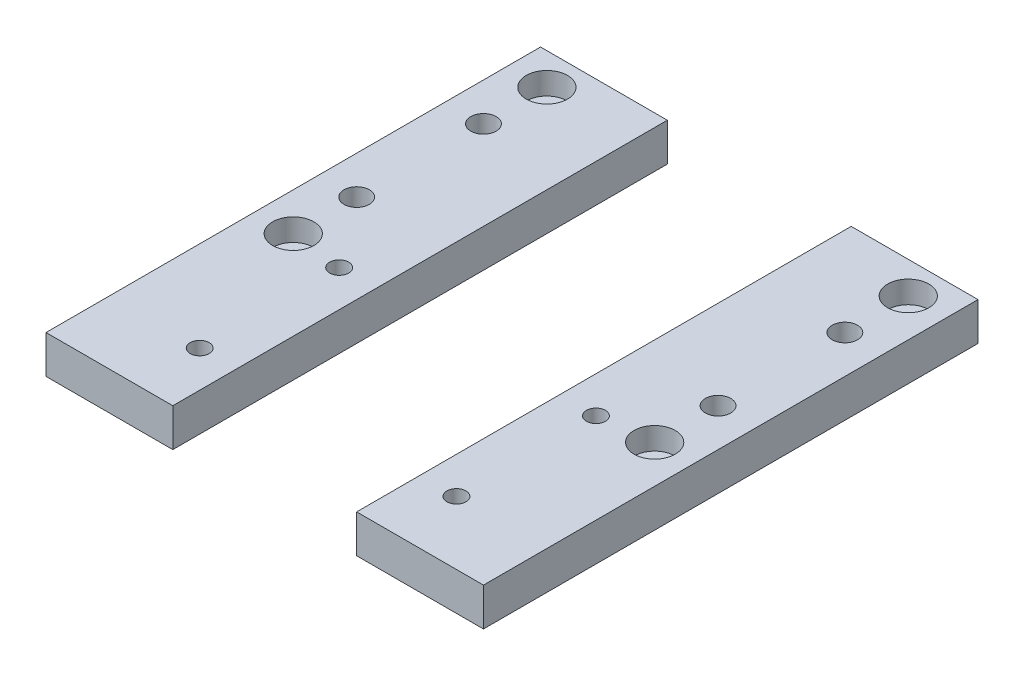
ISO-10303-21;
HEADER;
FILE_DESCRIPTION(('STEP AP214'),'2;1');
FILE_NAME('part.step','',(''),(''),'','','');
FILE_SCHEMA(('AUTOMOTIVE_DESIGN { 1 0 10303 214 1 1 1 1 }'));
ENDSEC;
DATA;
#1=APPLICATION_CONTEXT('core data for automotive mechanical design processes');
#2=APPLICATION_PROTOCOL_DEFINITION('international standard','automotive_design',2000,#1);
#3=PRODUCT_CONTEXT('',#1,'mechanical');
#4=PRODUCT('Part','Part','',(#3));
#5=PRODUCT_RELATED_PRODUCT_CATEGORY('part','',(#4));
#6=PRODUCT_DEFINITION_FORMATION('','',#4);
#7=PRODUCT_DEFINITION_CONTEXT('part definition',#1,'design');
#8=PRODUCT_DEFINITION('design','',#6,#7);
#9=PRODUCT_DEFINITION_SHAPE('','',#8);
#10=(LENGTH_UNIT() NAMED_UNIT(*) SI_UNIT(.MILLI.,.METRE.));
#11=(NAMED_UNIT(*) PLANE_ANGLE_UNIT() SI_UNIT($,.RADIAN.));
#12=(NAMED_UNIT(*) SI_UNIT($,.STERADIAN.) SOLID_ANGLE_UNIT());
#13=UNCERTAINTY_MEASURE_WITH_UNIT(LENGTH_MEASURE(1.E-05),#10,'distance_accuracy_value','');
#14=(GEOMETRIC_REPRESENTATION_CONTEXT(3) GLOBAL_UNCERTAINTY_ASSIGNED_CONTEXT((#13)) GLOBAL_UNIT_ASSIGNED_CONTEXT((#10,
#11,#12)) REPRESENTATION_CONTEXT('',''));
#15=CARTESIAN_POINT('',(0.,0.,0.));
#16=DIRECTION('',(0.,0.,1.));
#17=DIRECTION('',(1.,0.,0.));
#18=AXIS2_PLACEMENT_3D('',#15,#16,#17);
#19=CARTESIAN_POINT('',(62.9999999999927,-72.0000000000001,5.));
#20=DIRECTION('',(0.,1.,0.));
#21=DIRECTION('',(0.,0.,1.));
#22=AXIS2_PLACEMENT_3D('',#19,#20,#21);
#23=CYLINDRICAL_SURFACE('',#22,1.75);
#24=CARTESIAN_POINT('',(62.9999999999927,-1.11022302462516E-13,5.));
#25=DIRECTION('',(0.,1.,0.));
#26=DIRECTION('',(0.,0.,1.));
#27=AXIS2_PLACEMENT_3D('',#24,#25,#26);
#28=CIRCLE('',#27,1.75);
#29=CARTESIAN_POINT('',(62.9999999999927,-1.11022302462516E-13,6.75));
#30=VERTEX_POINT('',#29);
#31=EDGE_CURVE('E118',#30,#30,#28,.T.);
#32=ORIENTED_EDGE('',*,*,#31,.F.);
#33=EDGE_LOOP('',(#32));
#34=FACE_BOUND('',#33,.T.);
#35=CARTESIAN_POINT('',(62.9999999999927,2.49999999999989,5.));
#36=DIRECTION('',(0.,1.,0.));
#37=DIRECTION('',(0.,0.,1.));
#38=AXIS2_PLACEMENT_3D('',#35,#36,#37);
#39=CIRCLE('',#38,1.75);
#40=CARTESIAN_POINT('',(62.9999999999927,2.49999999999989,6.75));
#41=VERTEX_POINT('',#40);
#42=EDGE_CURVE('E46',#41,#41,#39,.F.);
#43=ORIENTED_EDGE('',*,*,#42,.F.);
#44=EDGE_LOOP('',(#43));
#45=FACE_BOUND('',#44,.T.);
#46=ADVANCED_FACE('F42',(#34,#45),#23,.F.);
#47=CARTESIAN_POINT('',(62.9999999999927,-72.0000000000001,45.));
#48=DIRECTION('',(0.,1.,0.));
#49=DIRECTION('',(0.,0.,1.));
#50=AXIS2_PLACEMENT_3D('',#47,#48,#49);
#51=CYLINDRICAL_SURFACE('',#50,1.75);
#52=CARTESIAN_POINT('',(62.9999999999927,-1.11022302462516E-13,45.));
#53=DIRECTION('',(0.,1.,0.));
#54=DIRECTION('',(0.,0.,1.));
#55=AXIS2_PLACEMENT_3D('',#52,#53,#54);
#56=CIRCLE('',#55,1.75);
#57=CARTESIAN_POINT('',(62.9999999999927,-1.11022302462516E-13,46.75));
#58=VERTEX_POINT('',#57);
#59=EDGE_CURVE('E121',#58,#58,#56,.T.);
#60=ORIENTED_EDGE('',*,*,#59,.F.);
#61=EDGE_LOOP('',(#60));
#62=FACE_BOUND('',#61,.T.);
#63=CARTESIAN_POINT('',(62.9999999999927,2.49999999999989,45.));
#64=DIRECTION('',(0.,1.,0.));
#65=DIRECTION('',(0.,0.,1.));
#66=AXIS2_PLACEMENT_3D('',#63,#64,#65);
#67=CIRCLE('',#66,1.75);
#68=CARTESIAN_POINT('',(62.9999999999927,2.49999999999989,46.75));
#69=VERTEX_POINT('',#68);
#70=EDGE_CURVE('E135',#69,#69,#67,.F.);
#71=ORIENTED_EDGE('',*,*,#70,.F.);
#72=EDGE_LOOP('',(#71));
#73=FACE_BOUND('',#72,.T.);
#74=ADVANCED_FACE('F178',(#62,#73),#51,.F.);
#75=CARTESIAN_POINT('',(68.9999999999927,-1.13686837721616E-13,78.));
#76=DIRECTION('',(-1.,0.,0.));
#77=DIRECTION('',(0.,0.,1.));
#78=AXIS2_PLACEMENT_3D('',#75,#76,#77);
#79=PLANE('',#78);
#80=DIRECTION('',(0.,1.,0.));
#81=VECTOR('',#80,1.);
#82=CARTESIAN_POINT('',(68.9999999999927,-1.13686837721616E-13,0.));
#83=LINE('',#82,#81);
#84=CARTESIAN_POINT('',(68.9999999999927,-1.13686837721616E-13,0.));
#85=VERTEX_POINT('',#84);
#86=CARTESIAN_POINT('',(68.9999999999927,5.99999999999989,0.));
#87=VERTEX_POINT('',#86);
#88=EDGE_CURVE('E109',#85,#87,#83,.T.);
#89=ORIENTED_EDGE('',*,*,#88,.T.);
#90=DIRECTION('',(0.,0.,-1.));
#91=VECTOR('',#90,1.);
#92=CARTESIAN_POINT('',(68.9999999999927,5.99999999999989,78.));
#93=LINE('',#92,#91);
#94=CARTESIAN_POINT('',(68.9999999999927,5.99999999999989,78.));
#95=VERTEX_POINT('',#94);
#96=EDGE_CURVE('E12',#95,#87,#93,.T.);
#97=ORIENTED_EDGE('',*,*,#96,.F.);
#98=DIRECTION('',(0.,1.,0.));
#99=VECTOR('',#98,1.);
#100=CARTESIAN_POINT('',(68.9999999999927,-1.13686837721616E-13,78.));
#101=LINE('',#100,#99);
#102=CARTESIAN_POINT('',(68.9999999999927,-1.13686837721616E-13,78.));
#103=VERTEX_POINT('',#102);
#104=EDGE_CURVE('E96',#103,#95,#101,.T.);
#105=ORIENTED_EDGE('',*,*,#104,.F.);
#106=DIRECTION('',(0.,0.,-1.));
#107=VECTOR('',#106,1.);
#108=CARTESIAN_POINT('',(68.9999999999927,-1.13686837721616E-13,78.));
#109=LINE('',#108,#107);
#110=EDGE_CURVE('E105',#103,#85,#109,.T.);
#111=ORIENTED_EDGE('',*,*,#110,.T.);
#112=EDGE_LOOP('',(#89,#97,#105,#111));
#113=FACE_BOUND('',#112,.T.);
#114=ADVANCED_FACE('F44',(#113),#79,.F.);
#115=CARTESIAN_POINT('',(68.9999999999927,5.99999999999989,78.));
#116=DIRECTION('',(0.,-1.,0.));
#117=DIRECTION('',(0.,0.,-1.));
#118=AXIS2_PLACEMENT_3D('',#115,#116,#117);
#119=PLANE('',#118);
#120=CARTESIAN_POINT('',(62.9999999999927,5.99999999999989,45.));
#121=DIRECTION('',(0.,1.,0.));
#122=DIRECTION('',(0.,0.,1.));
#123=AXIS2_PLACEMENT_3D('',#120,#121,#122);
#124=CIRCLE('',#123,3.25);
#125=CARTESIAN_POINT('',(62.9999999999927,5.99999999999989,48.25));
#126=VERTEX_POINT('',#125);
#127=EDGE_CURVE('E143',#126,#126,#124,.T.);
#128=ORIENTED_EDGE('',*,*,#127,.F.);
#129=EDGE_LOOP('',(#128));
#130=FACE_BOUND('',#129,.T.);
#131=CARTESIAN_POINT('',(62.9999999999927,5.99999999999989,5.));
#132=DIRECTION('',(0.,1.,0.));
#133=DIRECTION('',(0.,0.,1.));
#134=AXIS2_PLACEMENT_3D('',#131,#132,#133);
#135=CIRCLE('',#134,3.25);
#136=CARTESIAN_POINT('',(62.9999999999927,5.99999999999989,8.25));
#137=VERTEX_POINT('',#136);
#138=EDGE_CURVE('E153',#137,#137,#135,.T.);
#139=ORIENTED_EDGE('',*,*,#138,.F.);
#140=EDGE_LOOP('',(#139));
#141=FACE_BOUND('',#140,.T.);
#142=CARTESIAN_POINT('',(54.7499999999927,5.99999999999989,68.0120402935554));
#143=DIRECTION('',(0.,1.,0.));
#144=DIRECTION('',(0.,0.,1.));
#145=AXIS2_PLACEMENT_3D('',#142,#143,#144);
#146=CIRCLE('',#145,1.5);
#147=CARTESIAN_POINT('',(54.7499999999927,5.99999999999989,69.5120402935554));
#148=VERTEX_POINT('',#147);
#149=EDGE_CURVE('E122',#148,#148,#146,.T.);
#150=ORIENTED_EDGE('',*,*,#149,.F.);
#151=EDGE_LOOP('',(#150));
#152=FACE_BOUND('',#151,.T.);
#153=CARTESIAN_POINT('',(54.7499999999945,5.99999999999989,46.0120402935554));
#154=DIRECTION('',(0.,1.,0.));
#155=DIRECTION('',(0.,0.,1.));
#156=AXIS2_PLACEMENT_3D('',#153,#154,#155);
#157=CIRCLE('',#156,1.5);
#158=CARTESIAN_POINT('',(54.7499999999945,5.99999999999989,47.5120402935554));
#159=VERTEX_POINT('',#158);
#160=EDGE_CURVE('E158',#159,#159,#157,.T.);
#161=ORIENTED_EDGE('',*,*,#160,.F.);
#162=EDGE_LOOP('',(#161));
#163=FACE_BOUND('',#162,.T.);
#164=CARTESIAN_POINT('',(62.9999999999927,5.99999999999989,15.));
#165=DIRECTION('',(0.,1.,0.));
#166=DIRECTION('',(0.,0.,1.));
#167=AXIS2_PLACEMENT_3D('',#164,#165,#166);
#168=CIRCLE('',#167,2.00000000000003);
#169=CARTESIAN_POINT('',(62.9999999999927,5.99999999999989,17.));
#170=VERTEX_POINT('',#169);
#171=EDGE_CURVE('E161',#170,#170,#168,.T.);
#172=ORIENTED_EDGE('',*,*,#171,.F.);
#173=EDGE_LOOP('',(#172));
#174=FACE_BOUND('',#173,.T.);
#175=CARTESIAN_POINT('',(62.9999999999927,5.99999999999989,35.));
#176=DIRECTION('',(0.,1.,0.));
#177=DIRECTION('',(0.,0.,1.));
#178=AXIS2_PLACEMENT_3D('',#175,#176,#177);
#179=CIRCLE('',#178,2.00000000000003);
#180=CARTESIAN_POINT('',(62.9999999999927,5.99999999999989,37.));
#181=VERTEX_POINT('',#180);
#182=EDGE_CURVE('E141',#181,#181,#179,.T.);
#183=ORIENTED_EDGE('',*,*,#182,.F.);
#184=EDGE_LOOP('',(#183));
#185=FACE_BOUND('',#184,.T.);
#186=DIRECTION('',(-1.,0.,0.));
#187=VECTOR('',#186,1.);
#188=CARTESIAN_POINT('',(68.9999999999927,5.99999999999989,0.));
#189=LINE('',#188,#187);
#190=CARTESIAN_POINT('',(48.9999999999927,5.99999999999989,0.));
#191=VERTEX_POINT('',#190);
#192=EDGE_CURVE('E100',#87,#191,#189,.T.);
#193=ORIENTED_EDGE('',*,*,#192,.T.);
#194=DIRECTION('',(0.,0.,-1.));
#195=VECTOR('',#194,1.);
#196=CARTESIAN_POINT('',(48.9999999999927,5.99999999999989,78.));
#197=LINE('',#196,#195);
#198=CARTESIAN_POINT('',(48.9999999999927,5.99999999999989,78.));
#199=VERTEX_POINT('',#198);
#200=EDGE_CURVE('E52',#199,#191,#197,.T.);
#201=ORIENTED_EDGE('',*,*,#200,.F.);
#202=DIRECTION('',(-1.,0.,0.));
#203=VECTOR('',#202,1.);
#204=CARTESIAN_POINT('',(68.9999999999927,5.99999999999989,78.));
#205=LINE('',#204,#203);
#206=EDGE_CURVE('E91',#95,#199,#205,.T.);
#207=ORIENTED_EDGE('',*,*,#206,.F.);
#208=ORIENTED_EDGE('',*,*,#96,.T.);
#209=EDGE_LOOP('',(#193,#201,#207,#208));
#210=FACE_BOUND('',#209,.T.);
#211=ADVANCED_FACE('F99',(#130,#141,#152,#163,#174,#185,#210),#119,.F.);
#212=CARTESIAN_POINT('',(48.9999999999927,-1.13686837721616E-13,78.));
#213=DIRECTION('',(1.,0.,0.));
#214=DIRECTION('',(0.,0.,-1.));
#215=AXIS2_PLACEMENT_3D('',#212,#213,#214);
#216=PLANE('',#215);
#217=DIRECTION('',(0.,-1.,0.));
#218=VECTOR('',#217,1.);
#219=CARTESIAN_POINT('',(48.9999999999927,-1.13686837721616E-13,0.));
#220=LINE('',#219,#218);
#221=CARTESIAN_POINT('',(48.9999999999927,-1.13686837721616E-13,0.));
#222=VERTEX_POINT('',#221);
#223=EDGE_CURVE('E78',#191,#222,#220,.T.);
#224=ORIENTED_EDGE('',*,*,#223,.T.);
#225=DIRECTION('',(0.,0.,-1.));
#226=VECTOR('',#225,1.);
#227=CARTESIAN_POINT('',(48.9999999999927,-1.13686837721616E-13,78.));
#228=LINE('',#227,#226);
#229=CARTESIAN_POINT('',(48.9999999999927,-1.13686837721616E-13,78.));
#230=VERTEX_POINT('',#229);
#231=EDGE_CURVE('E101',#230,#222,#228,.T.);
#232=ORIENTED_EDGE('',*,*,#231,.F.);
#233=DIRECTION('',(0.,-1.,0.));
#234=VECTOR('',#233,1.);
#235=CARTESIAN_POINT('',(48.9999999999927,-1.13686837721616E-13,78.));
#236=LINE('',#235,#234);
#237=EDGE_CURVE('E94',#199,#230,#236,.T.);
#238=ORIENTED_EDGE('',*,*,#237,.F.);
#239=ORIENTED_EDGE('',*,*,#200,.T.);
#240=EDGE_LOOP('',(#224,#232,#238,#239));
#241=FACE_BOUND('',#240,.T.);
#242=ADVANCED_FACE('F103',(#241),#216,.F.);
#243=CARTESIAN_POINT('',(68.9999999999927,-1.13686837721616E-13,78.));
#244=DIRECTION('',(0.,1.,0.));
#245=DIRECTION('',(0.,0.,1.));
#246=AXIS2_PLACEMENT_3D('',#243,#244,#245);
#247=PLANE('',#246);
#248=CARTESIAN_POINT('',(54.7499999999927,-1.11022302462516E-13,68.0120402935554));
#249=DIRECTION('',(0.,1.,0.));
#250=DIRECTION('',(0.,0.,1.));
#251=AXIS2_PLACEMENT_3D('',#248,#249,#250);
#252=CIRCLE('',#251,1.5);
#253=CARTESIAN_POINT('',(54.7499999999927,-1.11022302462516E-13,69.5120402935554));
#254=VERTEX_POINT('',#253);
#255=EDGE_CURVE('E112',#254,#254,#252,.T.);
#256=ORIENTED_EDGE('',*,*,#255,.T.);
#257=EDGE_LOOP('',(#256));
#258=FACE_BOUND('',#257,.T.);
#259=CARTESIAN_POINT('',(54.7499999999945,-1.11022302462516E-13,46.0120402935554));
#260=DIRECTION('',(0.,1.,0.));
#261=DIRECTION('',(0.,0.,1.));
#262=AXIS2_PLACEMENT_3D('',#259,#260,#261);
#263=CIRCLE('',#262,1.5);
#264=CARTESIAN_POINT('',(54.7499999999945,-1.11022302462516E-13,47.5120402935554));
#265=VERTEX_POINT('',#264);
#266=EDGE_CURVE('E131',#265,#265,#263,.T.);
#267=ORIENTED_EDGE('',*,*,#266,.T.);
#268=EDGE_LOOP('',(#267));
#269=FACE_BOUND('',#268,.T.);
#270=CARTESIAN_POINT('',(62.9999999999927,-1.11022302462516E-13,15.));
#271=DIRECTION('',(0.,1.,0.));
#272=DIRECTION('',(0.,0.,1.));
#273=AXIS2_PLACEMENT_3D('',#270,#271,#272);
#274=CIRCLE('',#273,2.00000000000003);
#275=CARTESIAN_POINT('',(62.9999999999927,-1.11022302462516E-13,17.));
#276=VERTEX_POINT('',#275);
#277=EDGE_CURVE('E128',#276,#276,#274,.T.);
#278=ORIENTED_EDGE('',*,*,#277,.T.);
#279=EDGE_LOOP('',(#278));
#280=FACE_BOUND('',#279,.T.);
#281=CARTESIAN_POINT('',(62.9999999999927,-1.11022302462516E-13,35.));
#282=DIRECTION('',(0.,1.,0.));
#283=DIRECTION('',(0.,0.,1.));
#284=AXIS2_PLACEMENT_3D('',#281,#282,#283);
#285=CIRCLE('',#284,2.00000000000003);
#286=CARTESIAN_POINT('',(62.9999999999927,-1.11022302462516E-13,37.));
#287=VERTEX_POINT('',#286);
#288=EDGE_CURVE('E125',#287,#287,#285,.T.);
#289=ORIENTED_EDGE('',*,*,#288,.T.);
#290=EDGE_LOOP('',(#289));
#291=FACE_BOUND('',#290,.T.);
#292=ORIENTED_EDGE('',*,*,#59,.T.);
#293=EDGE_LOOP('',(#292));
#294=FACE_BOUND('',#293,.T.);
#295=ORIENTED_EDGE('',*,*,#31,.T.);
#296=EDGE_LOOP('',(#295));
#297=FACE_BOUND('',#296,.T.);
#298=DIRECTION('',(1.,0.,0.));
#299=VECTOR('',#298,1.);
#300=CARTESIAN_POINT('',(68.9999999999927,-1.13686837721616E-13,0.));
#301=LINE('',#300,#299);
#302=EDGE_CURVE('E84',#222,#85,#301,.T.);
#303=ORIENTED_EDGE('',*,*,#302,.T.);
#304=ORIENTED_EDGE('',*,*,#110,.F.);
#305=DIRECTION('',(1.,0.,0.));
#306=VECTOR('',#305,1.);
#307=CARTESIAN_POINT('',(68.9999999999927,-1.13686837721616E-13,78.));
#308=LINE('',#307,#306);
#309=EDGE_CURVE('E61',#230,#103,#308,.T.);
#310=ORIENTED_EDGE('',*,*,#309,.F.);
#311=ORIENTED_EDGE('',*,*,#231,.T.);
#312=EDGE_LOOP('',(#303,#304,#310,#311));
#313=FACE_BOUND('',#312,.T.);
#314=ADVANCED_FACE('F176',(#258,#269,#280,#291,#294,#297,#313),#247,.F.);
#315=CARTESIAN_POINT('',(68.9999999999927,5.99999999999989,78.));
#316=DIRECTION('',(0.,0.,1.));
#317=DIRECTION('',(1.,0.,0.));
#318=AXIS2_PLACEMENT_3D('',#315,#316,#317);
#319=PLANE('',#318);
#320=ORIENTED_EDGE('',*,*,#104,.T.);
#321=ORIENTED_EDGE('',*,*,#206,.T.);
#322=ORIENTED_EDGE('',*,*,#237,.T.);
#323=ORIENTED_EDGE('',*,*,#309,.T.);
#324=EDGE_LOOP('',(#320,#321,#322,#323));
#325=FACE_BOUND('',#324,.T.);
#326=ADVANCED_FACE('F92',(#325),#319,.T.);
#327=CARTESIAN_POINT('',(68.9999999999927,5.99999999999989,0.));
#328=DIRECTION('',(0.,0.,1.));
#329=DIRECTION('',(1.,0.,0.));
#330=AXIS2_PLACEMENT_3D('',#327,#328,#329);
#331=PLANE('',#330);
#332=ORIENTED_EDGE('',*,*,#88,.F.);
#333=ORIENTED_EDGE('',*,*,#302,.F.);
#334=ORIENTED_EDGE('',*,*,#223,.F.);
#335=ORIENTED_EDGE('',*,*,#192,.F.);
#336=EDGE_LOOP('',(#332,#333,#334,#335));
#337=FACE_BOUND('',#336,.T.);
#338=ADVANCED_FACE('F196',(#337),#331,.F.);
#339=CARTESIAN_POINT('',(62.9999999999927,-72.0000000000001,35.));
#340=DIRECTION('',(0.,1.,0.));
#341=DIRECTION('',(0.,0.,1.));
#342=AXIS2_PLACEMENT_3D('',#339,#340,#341);
#343=CYLINDRICAL_SURFACE('',#342,2.00000000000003);
#344=ORIENTED_EDGE('',*,*,#182,.T.);
#345=EDGE_LOOP('',(#344));
#346=FACE_BOUND('',#345,.T.);
#347=ORIENTED_EDGE('',*,*,#288,.F.);
#348=EDGE_LOOP('',(#347));
#349=FACE_BOUND('',#348,.T.);
#350=ADVANCED_FACE('F167',(#346,#349),#343,.F.);
#351=CARTESIAN_POINT('',(62.9999999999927,-72.0000000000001,15.));
#352=DIRECTION('',(0.,1.,0.));
#353=DIRECTION('',(0.,0.,1.));
#354=AXIS2_PLACEMENT_3D('',#351,#352,#353);
#355=CYLINDRICAL_SURFACE('',#354,2.00000000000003);
#356=ORIENTED_EDGE('',*,*,#171,.T.);
#357=EDGE_LOOP('',(#356));
#358=FACE_BOUND('',#357,.T.);
#359=ORIENTED_EDGE('',*,*,#277,.F.);
#360=EDGE_LOOP('',(#359));
#361=FACE_BOUND('',#360,.T.);
#362=ADVANCED_FACE('F216',(#358,#361),#355,.F.);
#363=CARTESIAN_POINT('',(54.7499999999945,-72.0000000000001,46.0120402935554));
#364=DIRECTION('',(0.,1.,0.));
#365=DIRECTION('',(0.,0.,1.));
#366=AXIS2_PLACEMENT_3D('',#363,#364,#365);
#367=CYLINDRICAL_SURFACE('',#366,1.5);
#368=ORIENTED_EDGE('',*,*,#160,.T.);
#369=EDGE_LOOP('',(#368));
#370=FACE_BOUND('',#369,.T.);
#371=ORIENTED_EDGE('',*,*,#266,.F.);
#372=EDGE_LOOP('',(#371));
#373=FACE_BOUND('',#372,.T.);
#374=ADVANCED_FACE('F220',(#370,#373),#367,.F.);
#375=CARTESIAN_POINT('',(54.7499999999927,-72.0000000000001,68.0120402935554));
#376=DIRECTION('',(0.,1.,0.));
#377=DIRECTION('',(0.,0.,1.));
#378=AXIS2_PLACEMENT_3D('',#375,#376,#377);
#379=CYLINDRICAL_SURFACE('',#378,1.5);
#380=ORIENTED_EDGE('',*,*,#149,.T.);
#381=EDGE_LOOP('',(#380));
#382=FACE_BOUND('',#381,.T.);
#383=ORIENTED_EDGE('',*,*,#255,.F.);
#384=EDGE_LOOP('',(#383));
#385=FACE_BOUND('',#384,.T.);
#386=ADVANCED_FACE('F226',(#382,#385),#379,.F.);
#387=CARTESIAN_POINT('',(62.9999999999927,2.49999999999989,45.));
#388=DIRECTION('',(0.,1.,0.));
#389=DIRECTION('',(0.,0.,1.));
#390=AXIS2_PLACEMENT_3D('',#387,#388,#389);
#391=PLANE('',#390);
#392=CARTESIAN_POINT('',(62.9999999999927,2.49999999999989,45.));
#393=DIRECTION('',(0.,1.,0.));
#394=DIRECTION('',(0.,0.,1.));
#395=AXIS2_PLACEMENT_3D('',#392,#393,#394);
#396=CIRCLE('',#395,3.25);
#397=CARTESIAN_POINT('',(62.9999999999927,2.49999999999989,48.25));
#398=VERTEX_POINT('',#397);
#399=EDGE_CURVE('E137',#398,#398,#396,.T.);
#400=ORIENTED_EDGE('',*,*,#399,.T.);
#401=EDGE_LOOP('',(#400));
#402=FACE_BOUND('',#401,.T.);
#403=ORIENTED_EDGE('',*,*,#70,.T.);
#404=EDGE_LOOP('',(#403));
#405=FACE_BOUND('',#404,.T.);
#406=ADVANCED_FACE('F230',(#402,#405),#391,.T.);
#407=CARTESIAN_POINT('',(62.9999999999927,2.49999999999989,45.));
#408=DIRECTION('',(0.,1.,0.));
#409=DIRECTION('',(0.,0.,1.));
#410=AXIS2_PLACEMENT_3D('',#407,#408,#409);
#411=CYLINDRICAL_SURFACE('',#410,3.25);
#412=ORIENTED_EDGE('',*,*,#399,.F.);
#413=EDGE_LOOP('',(#412));
#414=FACE_BOUND('',#413,.T.);
#415=ORIENTED_EDGE('',*,*,#127,.T.);
#416=EDGE_LOOP('',(#415));
#417=FACE_BOUND('',#416,.T.);
#418=ADVANCED_FACE('F239',(#414,#417),#411,.F.);
#419=CARTESIAN_POINT('',(62.9999999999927,2.49999999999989,5.));
#420=DIRECTION('',(0.,1.,0.));
#421=DIRECTION('',(0.,0.,1.));
#422=AXIS2_PLACEMENT_3D('',#419,#420,#421);
#423=PLANE('',#422);
#424=CARTESIAN_POINT('',(62.9999999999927,2.49999999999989,5.));
#425=DIRECTION('',(0.,1.,0.));
#426=DIRECTION('',(0.,0.,1.));
#427=AXIS2_PLACEMENT_3D('',#424,#425,#426);
#428=CIRCLE('',#427,3.25);
#429=CARTESIAN_POINT('',(62.9999999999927,2.49999999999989,8.25));
#430=VERTEX_POINT('',#429);
#431=EDGE_CURVE('E148',#430,#430,#428,.T.);
#432=ORIENTED_EDGE('',*,*,#431,.T.);
#433=EDGE_LOOP('',(#432));
#434=FACE_BOUND('',#433,.T.);
#435=ORIENTED_EDGE('',*,*,#42,.T.);
#436=EDGE_LOOP('',(#435));
#437=FACE_BOUND('',#436,.T.);
#438=ADVANCED_FACE('F235',(#434,#437),#423,.T.);
#439=CARTESIAN_POINT('',(62.9999999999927,2.49999999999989,5.));
#440=DIRECTION('',(0.,1.,0.));
#441=DIRECTION('',(0.,0.,1.));
#442=AXIS2_PLACEMENT_3D('',#439,#440,#441);
#443=CYLINDRICAL_SURFACE('',#442,3.25);
#444=ORIENTED_EDGE('',*,*,#431,.F.);
#445=EDGE_LOOP('',(#444));
#446=FACE_BOUND('',#445,.T.);
#447=ORIENTED_EDGE('',*,*,#138,.T.);
#448=EDGE_LOOP('',(#447));
#449=FACE_BOUND('',#448,.T.);
#450=ADVANCED_FACE('F232',(#446,#449),#443,.F.);
#451=CLOSED_SHELL('',(#46,#74,#114,#211,#242,#314,#326,#338,#350,#362,#374,#386,#406,#418,#438,#450));
#452=MANIFOLD_SOLID_BREP('B2',#451);
#453=CARTESIAN_POINT('',(6.,-72.0000000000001,45.));
#454=DIRECTION('',(0.,1.,0.));
#455=DIRECTION('',(0.,0.,1.));
#456=AXIS2_PLACEMENT_3D('',#453,#454,#455);
#457=CYLINDRICAL_SURFACE('',#456,1.75);
#458=CARTESIAN_POINT('',(6.,-1.11022302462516E-13,45.));
#459=DIRECTION('',(0.,1.,0.));
#460=DIRECTION('',(0.,0.,1.));
#461=AXIS2_PLACEMENT_3D('',#458,#459,#460);
#462=CIRCLE('',#461,1.75);
#463=CARTESIAN_POINT('',(6.,-1.11022302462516E-13,46.75));
#464=VERTEX_POINT('',#463);
#465=EDGE_CURVE('E470',#464,#464,#462,.T.);
#466=ORIENTED_EDGE('',*,*,#465,.F.);
#467=EDGE_LOOP('',(#466));
#468=FACE_BOUND('',#467,.T.);
#469=CARTESIAN_POINT('',(6.,2.49999999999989,45.));
#470=DIRECTION('',(0.,1.,0.));
#471=DIRECTION('',(0.,0.,1.));
#472=AXIS2_PLACEMENT_3D('',#469,#470,#471);
#473=CIRCLE('',#472,1.75);
#474=CARTESIAN_POINT('',(6.,2.49999999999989,46.75));
#475=VERTEX_POINT('',#474);
#476=EDGE_CURVE('E355',#475,#475,#473,.F.);
#477=ORIENTED_EDGE('',*,*,#476,.F.);
#478=EDGE_LOOP('',(#477));
#479=FACE_BOUND('',#478,.T.);
#480=ADVANCED_FACE('F351',(#468,#479),#457,.F.);
#481=CARTESIAN_POINT('',(6.,-72.0000000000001,5.));
#482=DIRECTION('',(0.,1.,0.));
#483=DIRECTION('',(0.,0.,1.));
#484=AXIS2_PLACEMENT_3D('',#481,#482,#483);
#485=CYLINDRICAL_SURFACE('',#484,1.75);
#486=CARTESIAN_POINT('',(6.,-1.11022302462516E-13,5.));
#487=DIRECTION('',(0.,1.,0.));
#488=DIRECTION('',(0.,0.,1.));
#489=AXIS2_PLACEMENT_3D('',#486,#487,#488);
#490=CIRCLE('',#489,1.75);
#491=CARTESIAN_POINT('',(6.,-1.11022302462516E-13,6.75));
#492=VERTEX_POINT('',#491);
#493=EDGE_CURVE('E421',#492,#492,#490,.T.);
#494=ORIENTED_EDGE('',*,*,#493,.F.);
#495=EDGE_LOOP('',(#494));
#496=FACE_BOUND('',#495,.T.);
#497=CARTESIAN_POINT('',(6.,2.49999999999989,5.));
#498=DIRECTION('',(0.,1.,0.));
#499=DIRECTION('',(0.,0.,1.));
#500=AXIS2_PLACEMENT_3D('',#497,#498,#499);
#501=CIRCLE('',#500,1.75);
#502=CARTESIAN_POINT('',(6.,2.49999999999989,6.75));
#503=VERTEX_POINT('',#502);
#504=EDGE_CURVE('E426',#503,#503,#501,.F.);
#505=ORIENTED_EDGE('',*,*,#504,.F.);
#506=EDGE_LOOP('',(#505));
#507=FACE_BOUND('',#506,.T.);
#508=ADVANCED_FACE('F478',(#496,#507),#485,.F.);
#509=CARTESIAN_POINT('',(0.,-1.13686837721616E-13,78.));
#510=DIRECTION('',(0.,1.,0.));
#511=DIRECTION('',(0.,0.,1.));
#512=AXIS2_PLACEMENT_3D('',#509,#510,#511);
#513=PLANE('',#512);
#514=ORIENTED_EDGE('',*,*,#493,.T.);
#515=EDGE_LOOP('',(#514));
#516=FACE_BOUND('',#515,.T.);
#517=ORIENTED_EDGE('',*,*,#465,.T.);
#518=EDGE_LOOP('',(#517));
#519=FACE_BOUND('',#518,.T.);
#520=CARTESIAN_POINT('',(6.,-1.11022302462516E-13,35.));
#521=DIRECTION('',(0.,1.,0.));
#522=DIRECTION('',(0.,0.,1.));
#523=AXIS2_PLACEMENT_3D('',#520,#521,#522);
#524=CIRCLE('',#523,2.00000000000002);
#525=CARTESIAN_POINT('',(6.,-1.11022302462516E-13,37.));
#526=VERTEX_POINT('',#525);
#527=EDGE_CURVE('E467',#526,#526,#524,.T.);
#528=ORIENTED_EDGE('',*,*,#527,.T.);
#529=EDGE_LOOP('',(#528));
#530=FACE_BOUND('',#529,.T.);
#531=CARTESIAN_POINT('',(6.,-1.11022302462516E-13,15.));
#532=DIRECTION('',(0.,1.,0.));
#533=DIRECTION('',(0.,0.,1.));
#534=AXIS2_PLACEMENT_3D('',#531,#532,#533);
#535=CIRCLE('',#534,2.00000000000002);
#536=CARTESIAN_POINT('',(6.,-1.11022302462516E-13,17.));
#537=VERTEX_POINT('',#536);
#538=EDGE_CURVE('E464',#537,#537,#535,.T.);
#539=ORIENTED_EDGE('',*,*,#538,.T.);
#540=EDGE_LOOP('',(#539));
#541=FACE_BOUND('',#540,.T.);
#542=CARTESIAN_POINT('',(14.25,-1.11022302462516E-13,46.0120402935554));
#543=DIRECTION('',(0.,1.,0.));
#544=DIRECTION('',(0.,0.,1.));
#545=AXIS2_PLACEMENT_3D('',#542,#543,#544);
#546=CIRCLE('',#545,1.5);
#547=CARTESIAN_POINT('',(14.25,-1.11022302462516E-13,47.5120402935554));
#548=VERTEX_POINT('',#547);
#549=EDGE_CURVE('E461',#548,#548,#546,.T.);
#550=ORIENTED_EDGE('',*,*,#549,.T.);
#551=EDGE_LOOP('',(#550));
#552=FACE_BOUND('',#551,.T.);
#553=CARTESIAN_POINT('',(14.2500000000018,-1.11022302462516E-13,68.0120402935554));
#554=DIRECTION('',(0.,1.,0.));
#555=DIRECTION('',(0.,0.,1.));
#556=AXIS2_PLACEMENT_3D('',#553,#554,#555);
#557=CIRCLE('',#556,1.5);
#558=CARTESIAN_POINT('',(14.2500000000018,-1.11022302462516E-13,69.5120402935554));
#559=VERTEX_POINT('',#558);
#560=EDGE_CURVE('E450',#559,#559,#557,.T.);
#561=ORIENTED_EDGE('',*,*,#560,.T.);
#562=EDGE_LOOP('',(#561));
#563=FACE_BOUND('',#562,.T.);
#564=DIRECTION('',(1.,0.,0.));
#565=VECTOR('',#564,1.);
#566=CARTESIAN_POINT('',(0.,-1.13686837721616E-13,0.));
#567=LINE('',#566,#565);
#568=CARTESIAN_POINT('',(0.,-1.13686837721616E-13,0.));
#569=VERTEX_POINT('',#568);
#570=CARTESIAN_POINT('',(20.,-1.13686837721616E-13,0.));
#571=VERTEX_POINT('',#570);
#572=EDGE_CURVE('E418',#569,#571,#567,.T.);
#573=ORIENTED_EDGE('',*,*,#572,.T.);
#574=DIRECTION('',(0.,0.,-1.));
#575=VECTOR('',#574,1.);
#576=CARTESIAN_POINT('',(20.,-1.13686837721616E-13,78.));
#577=LINE('',#576,#575);
#578=CARTESIAN_POINT('',(20.,-1.13686837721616E-13,78.));
#579=VERTEX_POINT('',#578);
#580=EDGE_CURVE('E40',#579,#571,#577,.T.);
#581=ORIENTED_EDGE('',*,*,#580,.F.);
#582=DIRECTION('',(1.,0.,0.));
#583=VECTOR('',#582,1.);
#584=CARTESIAN_POINT('',(0.,-1.13686837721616E-13,78.));
#585=LINE('',#584,#583);
#586=CARTESIAN_POINT('',(0.,-1.13686837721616E-13,78.));
#587=VERTEX_POINT('',#586);
#588=EDGE_CURVE('E405',#587,#579,#585,.T.);
#589=ORIENTED_EDGE('',*,*,#588,.F.);
#590=DIRECTION('',(0.,0.,-1.));
#591=VECTOR('',#590,1.);
#592=CARTESIAN_POINT('',(0.,-1.13686837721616E-13,78.));
#593=LINE('',#592,#591);
#594=EDGE_CURVE('E414',#587,#569,#593,.T.);
#595=ORIENTED_EDGE('',*,*,#594,.T.);
#596=EDGE_LOOP('',(#573,#581,#589,#595));
#597=FACE_BOUND('',#596,.T.);
#598=ADVANCED_FACE('F353',(#516,#519,#530,#541,#552,#563,#597),#513,.F.);
#599=CARTESIAN_POINT('',(20.,-1.13686837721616E-13,78.));
#600=DIRECTION('',(-1.,0.,0.));
#601=DIRECTION('',(0.,0.,1.));
#602=AXIS2_PLACEMENT_3D('',#599,#600,#601);
#603=PLANE('',#602);
#604=DIRECTION('',(0.,1.,0.));
#605=VECTOR('',#604,1.);
#606=CARTESIAN_POINT('',(20.,-1.13686837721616E-13,0.));
#607=LINE('',#606,#605);
#608=CARTESIAN_POINT('',(20.,5.99999999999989,0.));
#609=VERTEX_POINT('',#608);
#610=EDGE_CURVE('E409',#571,#609,#607,.T.);
#611=ORIENTED_EDGE('',*,*,#610,.T.);
#612=DIRECTION('',(0.,0.,-1.));
#613=VECTOR('',#612,1.);
#614=CARTESIAN_POINT('',(20.,5.99999999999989,78.));
#615=LINE('',#614,#613);
#616=CARTESIAN_POINT('',(20.,5.99999999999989,78.));
#617=VERTEX_POINT('',#616);
#618=EDGE_CURVE('E361',#617,#609,#615,.T.);
#619=ORIENTED_EDGE('',*,*,#618,.F.);
#620=DIRECTION('',(0.,1.,0.));
#621=VECTOR('',#620,1.);
#622=CARTESIAN_POINT('',(20.,-1.13686837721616E-13,78.));
#623=LINE('',#622,#621);
#624=EDGE_CURVE('E400',#579,#617,#623,.T.);
#625=ORIENTED_EDGE('',*,*,#624,.F.);
#626=ORIENTED_EDGE('',*,*,#580,.T.);
#627=EDGE_LOOP('',(#611,#619,#625,#626));
#628=FACE_BOUND('',#627,.T.);
#629=ADVANCED_FACE('F408',(#628),#603,.F.);
#630=CARTESIAN_POINT('',(0.,5.99999999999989,78.));
#631=DIRECTION('',(0.,-1.,0.));
#632=DIRECTION('',(0.,0.,-1.));
#633=AXIS2_PLACEMENT_3D('',#630,#631,#632);
#634=PLANE('',#633);
#635=CARTESIAN_POINT('',(6.,5.99999999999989,5.));
#636=DIRECTION('',(0.,1.,0.));
#637=DIRECTION('',(0.,0.,1.));
#638=AXIS2_PLACEMENT_3D('',#635,#636,#637);
#639=CIRCLE('',#638,3.25);
#640=CARTESIAN_POINT('',(6.,5.99999999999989,8.25));
#641=VERTEX_POINT('',#640);
#642=EDGE_CURVE('E434',#641,#641,#639,.T.);
#643=ORIENTED_EDGE('',*,*,#642,.F.);
#644=EDGE_LOOP('',(#643));
#645=FACE_BOUND('',#644,.T.);
#646=CARTESIAN_POINT('',(6.,5.99999999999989,45.));
#647=DIRECTION('',(0.,1.,0.));
#648=DIRECTION('',(0.,0.,1.));
#649=AXIS2_PLACEMENT_3D('',#646,#647,#648);
#650=CIRCLE('',#649,3.25);
#651=CARTESIAN_POINT('',(6.,5.99999999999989,48.25));
#652=VERTEX_POINT('',#651);
#653=EDGE_CURVE('E444',#652,#652,#650,.T.);
#654=ORIENTED_EDGE('',*,*,#653,.F.);
#655=EDGE_LOOP('',(#654));
#656=FACE_BOUND('',#655,.T.);
#657=CARTESIAN_POINT('',(6.,5.99999999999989,35.));
#658=DIRECTION('',(0.,1.,0.));
#659=DIRECTION('',(0.,0.,1.));
#660=AXIS2_PLACEMENT_3D('',#657,#658,#659);
#661=CIRCLE('',#660,2.00000000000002);
#662=CARTESIAN_POINT('',(6.,5.99999999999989,37.));
#663=VERTEX_POINT('',#662);
#664=EDGE_CURVE('E447',#663,#663,#661,.T.);
#665=ORIENTED_EDGE('',*,*,#664,.F.);
#666=EDGE_LOOP('',(#665));
#667=FACE_BOUND('',#666,.T.);
#668=CARTESIAN_POINT('',(6.,5.99999999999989,15.));
#669=DIRECTION('',(0.,1.,0.));
#670=DIRECTION('',(0.,0.,1.));
#671=AXIS2_PLACEMENT_3D('',#668,#669,#670);
#672=CIRCLE('',#671,2.00000000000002);
#673=CARTESIAN_POINT('',(6.,5.99999999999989,17.));
#674=VERTEX_POINT('',#673);
#675=EDGE_CURVE('E451',#674,#674,#672,.T.);
#676=ORIENTED_EDGE('',*,*,#675,.F.);
#677=EDGE_LOOP('',(#676));
#678=FACE_BOUND('',#677,.T.);
#679=CARTESIAN_POINT('',(14.25,5.99999999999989,46.0120402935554));
#680=DIRECTION('',(0.,1.,0.));
#681=DIRECTION('',(0.,0.,1.));
#682=AXIS2_PLACEMENT_3D('',#679,#680,#681);
#683=CIRCLE('',#682,1.5);
#684=CARTESIAN_POINT('',(14.25,5.99999999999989,47.5120402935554));
#685=VERTEX_POINT('',#684);
#686=EDGE_CURVE('E454',#685,#685,#683,.T.);
#687=ORIENTED_EDGE('',*,*,#686,.F.);
#688=EDGE_LOOP('',(#687));
#689=FACE_BOUND('',#688,.T.);
#690=CARTESIAN_POINT('',(14.2500000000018,5.99999999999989,68.0120402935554));
#691=DIRECTION('',(0.,1.,0.));
#692=DIRECTION('',(0.,0.,1.));
#693=AXIS2_PLACEMENT_3D('',#690,#691,#692);
#694=CIRCLE('',#693,1.5);
#695=CARTESIAN_POINT('',(14.2500000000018,5.99999999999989,69.5120402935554));
#696=VERTEX_POINT('',#695);
#697=EDGE_CURVE('E432',#696,#696,#694,.T.);
#698=ORIENTED_EDGE('',*,*,#697,.F.);
#699=EDGE_LOOP('',(#698));
#700=FACE_BOUND('',#699,.T.);
#701=DIRECTION('',(-1.,0.,0.));
#702=VECTOR('',#701,1.);
#703=CARTESIAN_POINT('',(0.,5.99999999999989,0.));
#704=LINE('',#703,#702);
#705=CARTESIAN_POINT('',(0.,5.99999999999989,0.));
#706=VERTEX_POINT('',#705);
#707=EDGE_CURVE('E387',#609,#706,#704,.T.);
#708=ORIENTED_EDGE('',*,*,#707,.T.);
#709=DIRECTION('',(0.,0.,-1.));
#710=VECTOR('',#709,1.);
#711=CARTESIAN_POINT('',(0.,5.99999999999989,78.));
#712=LINE('',#711,#710);
#713=CARTESIAN_POINT('',(0.,5.99999999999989,78.));
#714=VERTEX_POINT('',#713);
#715=EDGE_CURVE('E410',#714,#706,#712,.T.);
#716=ORIENTED_EDGE('',*,*,#715,.F.);
#717=DIRECTION('',(-1.,0.,0.));
#718=VECTOR('',#717,1.);
#719=CARTESIAN_POINT('',(0.,5.99999999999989,78.));
#720=LINE('',#719,#718);
#721=EDGE_CURVE('E403',#617,#714,#720,.T.);
#722=ORIENTED_EDGE('',*,*,#721,.F.);
#723=ORIENTED_EDGE('',*,*,#618,.T.);
#724=EDGE_LOOP('',(#708,#716,#722,#723));
#725=FACE_BOUND('',#724,.T.);
#726=ADVANCED_FACE('F412',(#645,#656,#667,#678,#689,#700,#725),#634,.F.);
#727=CARTESIAN_POINT('',(0.,-1.13686837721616E-13,78.));
#728=DIRECTION('',(1.,0.,0.));
#729=DIRECTION('',(0.,0.,-1.));
#730=AXIS2_PLACEMENT_3D('',#727,#728,#729);
#731=PLANE('',#730);
#732=DIRECTION('',(0.,-1.,0.));
#733=VECTOR('',#732,1.);
#734=CARTESIAN_POINT('',(0.,-1.13686837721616E-13,0.));
#735=LINE('',#734,#733);
#736=EDGE_CURVE('E393',#706,#569,#735,.T.);
#737=ORIENTED_EDGE('',*,*,#736,.T.);
#738=ORIENTED_EDGE('',*,*,#594,.F.);
#739=DIRECTION('',(0.,-1.,0.));
#740=VECTOR('',#739,1.);
#741=CARTESIAN_POINT('',(0.,-1.13686837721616E-13,78.));
#742=LINE('',#741,#740);
#743=EDGE_CURVE('E370',#714,#587,#742,.T.);
#744=ORIENTED_EDGE('',*,*,#743,.F.);
#745=ORIENTED_EDGE('',*,*,#715,.T.);
#746=EDGE_LOOP('',(#737,#738,#744,#745));
#747=FACE_BOUND('',#746,.T.);
#748=ADVANCED_FACE('F512',(#747),#731,.F.);
#749=CARTESIAN_POINT('',(20.,-1.13686837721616E-13,78.));
#750=DIRECTION('',(0.,0.,1.));
#751=DIRECTION('',(1.,0.,0.));
#752=AXIS2_PLACEMENT_3D('',#749,#750,#751);
#753=PLANE('',#752);
#754=ORIENTED_EDGE('',*,*,#588,.T.);
#755=ORIENTED_EDGE('',*,*,#624,.T.);
#756=ORIENTED_EDGE('',*,*,#721,.T.);
#757=ORIENTED_EDGE('',*,*,#743,.T.);
#758=EDGE_LOOP('',(#754,#755,#756,#757));
#759=FACE_BOUND('',#758,.T.);
#760=ADVANCED_FACE('F401',(#759),#753,.T.);
#761=CARTESIAN_POINT('',(20.,-1.13686837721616E-13,0.));
#762=DIRECTION('',(0.,0.,1.));
#763=DIRECTION('',(1.,0.,0.));
#764=AXIS2_PLACEMENT_3D('',#761,#762,#763);
#765=PLANE('',#764);
#766=ORIENTED_EDGE('',*,*,#572,.F.);
#767=ORIENTED_EDGE('',*,*,#736,.F.);
#768=ORIENTED_EDGE('',*,*,#707,.F.);
#769=ORIENTED_EDGE('',*,*,#610,.F.);
#770=EDGE_LOOP('',(#766,#767,#768,#769));
#771=FACE_BOUND('',#770,.T.);
#772=ADVANCED_FACE('F508',(#771),#765,.F.);
#773=CARTESIAN_POINT('',(14.2500000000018,-72.0000000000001,68.0120402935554));
#774=DIRECTION('',(0.,1.,0.));
#775=DIRECTION('',(0.,0.,1.));
#776=AXIS2_PLACEMENT_3D('',#773,#774,#775);
#777=CYLINDRICAL_SURFACE('',#776,1.5);
#778=ORIENTED_EDGE('',*,*,#697,.T.);
#779=EDGE_LOOP('',(#778));
#780=FACE_BOUND('',#779,.T.);
#781=ORIENTED_EDGE('',*,*,#560,.F.);
#782=EDGE_LOOP('',(#781));
#783=FACE_BOUND('',#782,.T.);
#784=ADVANCED_FACE('F504',(#780,#783),#777,.F.);
#785=CARTESIAN_POINT('',(14.25,-72.0000000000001,46.0120402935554));
#786=DIRECTION('',(0.,1.,0.));
#787=DIRECTION('',(0.,0.,1.));
#788=AXIS2_PLACEMENT_3D('',#785,#786,#787);
#789=CYLINDRICAL_SURFACE('',#788,1.5);
#790=ORIENTED_EDGE('',*,*,#686,.T.);
#791=EDGE_LOOP('',(#790));
#792=FACE_BOUND('',#791,.T.);
#793=ORIENTED_EDGE('',*,*,#549,.F.);
#794=EDGE_LOOP('',(#793));
#795=FACE_BOUND('',#794,.T.);
#796=ADVANCED_FACE('F500',(#792,#795),#789,.F.);
#797=CARTESIAN_POINT('',(6.,-72.0000000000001,15.));
#798=DIRECTION('',(0.,1.,0.));
#799=DIRECTION('',(0.,0.,1.));
#800=AXIS2_PLACEMENT_3D('',#797,#798,#799);
#801=CYLINDRICAL_SURFACE('',#800,2.00000000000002);
#802=ORIENTED_EDGE('',*,*,#675,.T.);
#803=EDGE_LOOP('',(#802));
#804=FACE_BOUND('',#803,.T.);
#805=ORIENTED_EDGE('',*,*,#538,.F.);
#806=EDGE_LOOP('',(#805));
#807=FACE_BOUND('',#806,.T.);
#808=ADVANCED_FACE('F496',(#804,#807),#801,.F.);
#809=CARTESIAN_POINT('',(6.,-72.0000000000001,35.));
#810=DIRECTION('',(0.,1.,0.));
#811=DIRECTION('',(0.,0.,1.));
#812=AXIS2_PLACEMENT_3D('',#809,#810,#811);
#813=CYLINDRICAL_SURFACE('',#812,2.00000000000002);
#814=ORIENTED_EDGE('',*,*,#664,.T.);
#815=EDGE_LOOP('',(#814));
#816=FACE_BOUND('',#815,.T.);
#817=ORIENTED_EDGE('',*,*,#527,.F.);
#818=EDGE_LOOP('',(#817));
#819=FACE_BOUND('',#818,.T.);
#820=ADVANCED_FACE('F492',(#816,#819),#813,.F.);
#821=CARTESIAN_POINT('',(6.,2.49999999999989,5.));
#822=DIRECTION('',(0.,1.,0.));
#823=DIRECTION('',(0.,0.,1.));
#824=AXIS2_PLACEMENT_3D('',#821,#822,#823);
#825=PLANE('',#824);
#826=CARTESIAN_POINT('',(6.,2.49999999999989,5.));
#827=DIRECTION('',(0.,1.,0.));
#828=DIRECTION('',(0.,0.,1.));
#829=AXIS2_PLACEMENT_3D('',#826,#827,#828);
#830=CIRCLE('',#829,3.25);
#831=CARTESIAN_POINT('',(6.,2.49999999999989,8.25));
#832=VERTEX_POINT('',#831);
#833=EDGE_CURVE('E428',#832,#832,#830,.T.);
#834=ORIENTED_EDGE('',*,*,#833,.T.);
#835=EDGE_LOOP('',(#834));
#836=FACE_BOUND('',#835,.T.);
#837=ORIENTED_EDGE('',*,*,#504,.T.);
#838=EDGE_LOOP('',(#837));
#839=FACE_BOUND('',#838,.T.);
#840=ADVANCED_FACE('F495',(#836,#839),#825,.T.);
#841=CARTESIAN_POINT('',(6.,2.49999999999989,5.));
#842=DIRECTION('',(0.,1.,0.));
#843=DIRECTION('',(0.,0.,1.));
#844=AXIS2_PLACEMENT_3D('',#841,#842,#843);
#845=CYLINDRICAL_SURFACE('',#844,3.25);
#846=ORIENTED_EDGE('',*,*,#833,.F.);
#847=EDGE_LOOP('',(#846));
#848=FACE_BOUND('',#847,.T.);
#849=ORIENTED_EDGE('',*,*,#642,.T.);
#850=EDGE_LOOP('',(#849));
#851=FACE_BOUND('',#850,.T.);
#852=ADVANCED_FACE('F564',(#848,#851),#845,.F.);
#853=CARTESIAN_POINT('',(6.,2.49999999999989,45.));
#854=DIRECTION('',(0.,1.,0.));
#855=DIRECTION('',(0.,0.,1.));
#856=AXIS2_PLACEMENT_3D('',#853,#854,#855);
#857=PLANE('',#856);
#858=CARTESIAN_POINT('',(6.,2.49999999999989,45.));
#859=DIRECTION('',(0.,1.,0.));
#860=DIRECTION('',(0.,0.,1.));
#861=AXIS2_PLACEMENT_3D('',#858,#859,#860);
#862=CIRCLE('',#861,3.25);
#863=CARTESIAN_POINT('',(6.,2.49999999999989,48.25));
#864=VERTEX_POINT('',#863);
#865=EDGE_CURVE('E439',#864,#864,#862,.T.);
#866=ORIENTED_EDGE('',*,*,#865,.T.);
#867=EDGE_LOOP('',(#866));
#868=FACE_BOUND('',#867,.T.);
#869=ORIENTED_EDGE('',*,*,#476,.T.);
#870=EDGE_LOOP('',(#869));
#871=FACE_BOUND('',#870,.T.);
#872=ADVANCED_FACE('F571',(#868,#871),#857,.T.);
#873=CARTESIAN_POINT('',(6.,2.49999999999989,45.));
#874=DIRECTION('',(0.,1.,0.));
#875=DIRECTION('',(0.,0.,1.));
#876=AXIS2_PLACEMENT_3D('',#873,#874,#875);
#877=CYLINDRICAL_SURFACE('',#876,3.25);
#878=ORIENTED_EDGE('',*,*,#865,.F.);
#879=EDGE_LOOP('',(#878));
#880=FACE_BOUND('',#879,.T.);
#881=ORIENTED_EDGE('',*,*,#653,.T.);
#882=EDGE_LOOP('',(#881));
#883=FACE_BOUND('',#882,.T.);
#884=ADVANCED_FACE('F489',(#880,#883),#877,.F.);
#885=CLOSED_SHELL('',(#480,#508,#598,#629,#726,#748,#760,#772,#784,#796,#808,#820,#840,#852,
#872,#884));
#886=MANIFOLD_SOLID_BREP('B6',#885);
#887=ADVANCED_BREP_SHAPE_REPRESENTATION('',(#18,#452,#886),#14);
#888=SHAPE_DEFINITION_REPRESENTATION(#9,#887);
ENDSEC;
END-ISO-10303-21;
